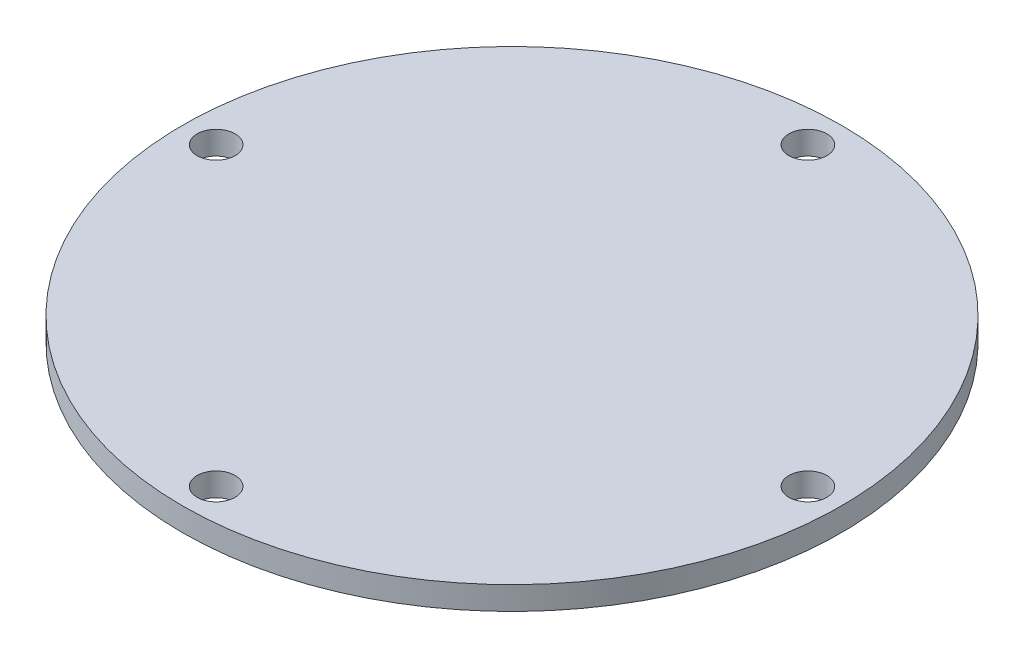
from build123d import *

# Parameters (mm, degrees)
SKETCH1_R           = 45
BOSS_EXTRUDE1_DEPTH = 3.175
CIRPATTERN1_COUNT   = 4


with BuildPart() as part:
    # Sketch1 → Boss-Extrude1 (new body)
    with BuildSketch(Plane(origin=(0, 0, 0), x_dir=(1, 0, 0), z_dir=(0, 1, 0))):
        with Locations(Location((0, 0, 0), (0, 0, 270))):
            Circle(SKETCH1_R)
    extrude(amount=BOSS_EXTRUDE1_DEPTH)

    # Sketch3 → 6 _0.204_ Diameter Hole1 (revolve, cut)
    with BuildSketch(Plane(origin=(40.4, 3.175, 0), x_dir=(0, 0, 1), z_dir=(1, 0, 0))):
        Polygon((0, 0), (0, 41.556709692), (2.5908, 40), (2.5908, 0), align=None)
    f_6_0_204_diameter_hole1 = revolve(axis=Axis((40.4, 9.525, 0), (0, -1, 0)), mode=Mode.SUBTRACT)

    # CirPattern1: 6 _0.204_ Diameter Hole1 ×4 about axis
    cirpattern1_axis = Axis((0, 0, 0), (0, 1, 0))
    for i in range(1, CIRPATTERN1_COUNT):
        add(f_6_0_204_diameter_hole1.rotate(cirpattern1_axis, i * 360 / CIRPATTERN1_COUNT), mode=Mode.SUBTRACT)


solid = part.part
